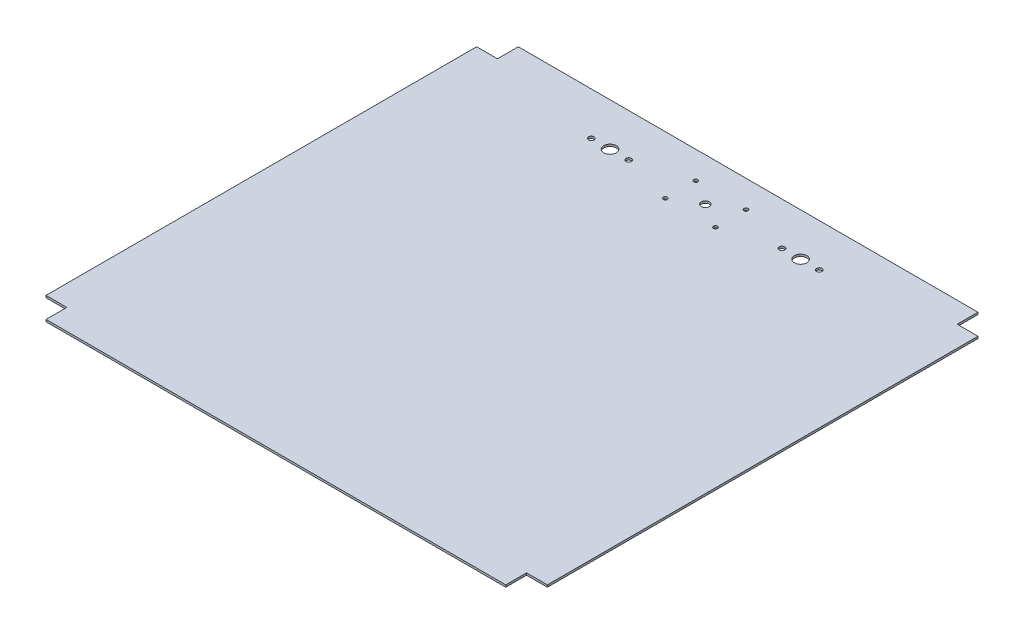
from build123d import *

# Parameters (mm, degrees)
SKETCH1_W           = 482
SKETCH1_H           = 454
BOSS_EXTRUDE1_DEPTH = 2
SKETCH3_W           = 20
SKETCH3_H           = 20
CUT_EXTRUDE3_DEPTH  = 2
SKETCH4_R           = 3.9
SKETCH4_R_2         = 1.95
SKETCH4_R_3         = 6
SKETCH4_R_4         = 2.65
CUT_EXTRUDE4_DEPTH  = 2


with BuildPart() as part:
    # Sketch1 → Boss-Extrude1 (new body)
    with BuildSketch(Plane(origin=(0, 0, 0), x_dir=(1, 0, 0), z_dir=(0, 1, 0))):
        Rectangle(SKETCH1_W, SKETCH1_H)
    extrude(amount=BOSS_EXTRUDE1_DEPTH)

    # Sketch3 → Cut-Extrude3 (cut)
    with BuildSketch(Plane(origin=(0, 2, 0), x_dir=(1, 0, 0), z_dir=(0, 1, 0))):
        with Locations((-231, 217)):
            Rectangle(SKETCH3_W, SKETCH3_H)
        with Locations((231, 217)):
            Rectangle(SKETCH3_W, SKETCH3_H)
        with Locations((231, -217)):
            Rectangle(SKETCH3_W, SKETCH3_H)
        with Locations((-231, -217)):
            Rectangle(SKETCH3_W, SKETCH3_H)
    extrude(amount=-CUT_EXTRUDE3_DEPTH, mode=Mode.SUBTRACT)

    # Sketch4 → Cut-Extrude4 (cut)
    with BuildSketch(Plane(origin=(0, 2, 0), x_dir=(1, 0, 0), z_dir=(0, 1, 0))):
        with Locations(Location((0, 185.85, 0), (0, 0, 270))):
            Circle(SKETCH4_R)
        with Locations(Location((-24.1, 200.85, 0), (0, 0, 270))):
            Circle(SKETCH4_R_2)
        with Locations(Location((-24.1, 171.55, 0), (0, 0, 270))):
            Circle(SKETCH4_R_2)
        with Locations(Location((24.1, 200.85, 0), (0, 0, 270))):
            Circle(SKETCH4_R_2)
        with Locations(Location((24.1, 171.55, 0), (0, 0, 270))):
            Circle(SKETCH4_R_2)
        with Locations(Location((-91.6, 185.85, 0), (0, 0, 270))):
            Circle(SKETCH4_R_3)
        with Locations(Location((-73.65, 185.85, 0), (0, 0, 270))):
            Circle(SKETCH4_R_4)
        with Locations(Location((-109.55, 185.85, 0), (0, 0, 270))):
            Circle(SKETCH4_R_4)
        with Locations(Location((91.6, 185.85, 0), (0, 0, 90))):
            Circle(SKETCH4_R_3)
        with Locations(Location((109.55, 185.85, 0), (0, 0, 90))):
            Circle(SKETCH4_R_4)
        with Locations(Location((73.65, 185.85, 0), (0, 0, 90))):
            Circle(SKETCH4_R_4)
    extrude(amount=-CUT_EXTRUDE4_DEPTH, mode=Mode.SUBTRACT)


solid = part.part
